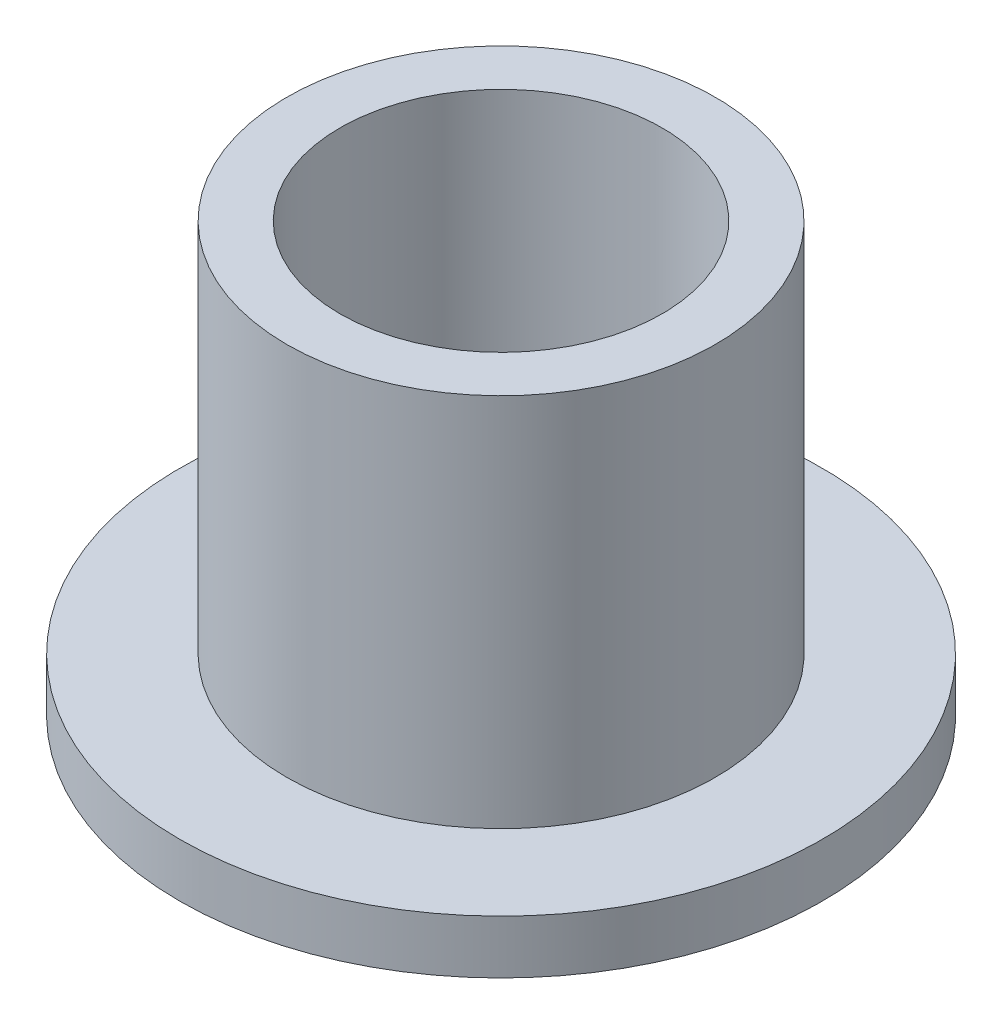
ISO-10303-21;
HEADER;
FILE_DESCRIPTION(('STEP AP214'),'2;1');
FILE_NAME('part.step','',(''),(''),'','','');
FILE_SCHEMA(('AUTOMOTIVE_DESIGN { 1 0 10303 214 1 1 1 1 }'));
ENDSEC;
DATA;
#1=APPLICATION_CONTEXT('core data for automotive mechanical design processes');
#2=APPLICATION_PROTOCOL_DEFINITION('international standard','automotive_design',2000,#1);
#3=PRODUCT_CONTEXT('',#1,'mechanical');
#4=PRODUCT('Part','Part','',(#3));
#5=PRODUCT_RELATED_PRODUCT_CATEGORY('part','',(#4));
#6=PRODUCT_DEFINITION_FORMATION('','',#4);
#7=PRODUCT_DEFINITION_CONTEXT('part definition',#1,'design');
#8=PRODUCT_DEFINITION('design','',#6,#7);
#9=PRODUCT_DEFINITION_SHAPE('','',#8);
#10=(LENGTH_UNIT() NAMED_UNIT(*) SI_UNIT(.MILLI.,.METRE.));
#11=(NAMED_UNIT(*) PLANE_ANGLE_UNIT() SI_UNIT($,.RADIAN.));
#12=(NAMED_UNIT(*) SI_UNIT($,.STERADIAN.) SOLID_ANGLE_UNIT());
#13=UNCERTAINTY_MEASURE_WITH_UNIT(LENGTH_MEASURE(1.E-05),#10,'distance_accuracy_value','');
#14=(GEOMETRIC_REPRESENTATION_CONTEXT(3) GLOBAL_UNCERTAINTY_ASSIGNED_CONTEXT((#13)) GLOBAL_UNIT_ASSIGNED_CONTEXT((#10,
#11,#12)) REPRESENTATION_CONTEXT('',''));
#15=CARTESIAN_POINT('',(0.,0.,0.));
#16=DIRECTION('',(0.,0.,1.));
#17=DIRECTION('',(1.,0.,0.));
#18=AXIS2_PLACEMENT_3D('',#15,#16,#17);
#19=CARTESIAN_POINT('',(0.,6.35,0.));
#20=DIRECTION('',(0.,1.,0.));
#21=DIRECTION('',(0.,0.,1.));
#22=AXIS2_PLACEMENT_3D('',#19,#20,#21);
#23=PLANE('',#22);
#24=CARTESIAN_POINT('',(0.,6.35,0.));
#25=DIRECTION('',(0.,1.,0.));
#26=DIRECTION('',(0.,0.,1.));
#27=AXIS2_PLACEMENT_3D('',#24,#25,#26);
#28=CIRCLE('',#27,3.175);
#29=CARTESIAN_POINT('',(0.,6.35,3.175));
#30=VERTEX_POINT('',#29);
#31=EDGE_CURVE('E10',#30,#30,#28,.T.);
#32=ORIENTED_EDGE('',*,*,#31,.T.);
#33=EDGE_LOOP('',(#32));
#34=FACE_BOUND('',#33,.T.);
#35=CARTESIAN_POINT('',(0.,6.35,0.));
#36=DIRECTION('',(0.,1.,0.));
#37=DIRECTION('',(0.,0.,1.));
#38=AXIS2_PLACEMENT_3D('',#35,#36,#37);
#39=CIRCLE('',#38,2.3876);
#40=CARTESIAN_POINT('',(0.,6.35,2.3876));
#41=VERTEX_POINT('',#40);
#42=EDGE_CURVE('E39',#41,#41,#39,.T.);
#43=ORIENTED_EDGE('',*,*,#42,.F.);
#44=EDGE_LOOP('',(#43));
#45=FACE_BOUND('',#44,.T.);
#46=ADVANCED_FACE('F32',(#34,#45),#23,.T.);
#47=CARTESIAN_POINT('',(0.,0.,0.));
#48=DIRECTION('',(0.,1.,0.));
#49=DIRECTION('',(0.,0.,1.));
#50=AXIS2_PLACEMENT_3D('',#47,#48,#49);
#51=PLANE('',#50);
#52=CARTESIAN_POINT('',(0.,0.,0.));
#53=DIRECTION('',(0.,1.,0.));
#54=DIRECTION('',(0.,0.,1.));
#55=AXIS2_PLACEMENT_3D('',#52,#53,#54);
#56=CIRCLE('',#55,2.3876);
#57=CARTESIAN_POINT('',(0.,0.,2.3876));
#58=VERTEX_POINT('',#57);
#59=EDGE_CURVE('E43',#58,#58,#56,.T.);
#60=ORIENTED_EDGE('',*,*,#59,.T.);
#61=EDGE_LOOP('',(#60));
#62=FACE_BOUND('',#61,.T.);
#63=CARTESIAN_POINT('',(0.,0.,0.));
#64=DIRECTION('',(0.,1.,0.));
#65=DIRECTION('',(0.,0.,1.));
#66=AXIS2_PLACEMENT_3D('',#63,#64,#65);
#67=CIRCLE('',#66,4.7625);
#68=CARTESIAN_POINT('',(0.,0.,4.7625));
#69=VERTEX_POINT('',#68);
#70=EDGE_CURVE('E50',#69,#69,#67,.T.);
#71=ORIENTED_EDGE('',*,*,#70,.F.);
#72=EDGE_LOOP('',(#71));
#73=FACE_BOUND('',#72,.T.);
#74=ADVANCED_FACE('F75',(#62,#73),#51,.F.);
#75=CARTESIAN_POINT('',(0.,6.35,0.));
#76=DIRECTION('',(0.,-1.,0.));
#77=DIRECTION('',(0.,0.,-1.));
#78=AXIS2_PLACEMENT_3D('',#75,#76,#77);
#79=CYLINDRICAL_SURFACE('',#78,3.175);
#80=CARTESIAN_POINT('',(0.,0.79375,0.));
#81=DIRECTION('',(0.,1.,0.));
#82=DIRECTION('',(0.,0.,1.));
#83=AXIS2_PLACEMENT_3D('',#80,#81,#82);
#84=CIRCLE('',#83,3.175);
#85=CARTESIAN_POINT('',(0.,0.79375,3.175));
#86=VERTEX_POINT('',#85);
#87=EDGE_CURVE('E53',#86,#86,#84,.T.);
#88=ORIENTED_EDGE('',*,*,#87,.T.);
#89=EDGE_LOOP('',(#88));
#90=FACE_BOUND('',#89,.T.);
#91=ORIENTED_EDGE('',*,*,#31,.F.);
#92=EDGE_LOOP('',(#91));
#93=FACE_BOUND('',#92,.T.);
#94=ADVANCED_FACE('F34',(#90,#93),#79,.T.);
#95=CARTESIAN_POINT('',(0.,6.35,0.));
#96=DIRECTION('',(0.,-1.,0.));
#97=DIRECTION('',(0.,0.,-1.));
#98=AXIS2_PLACEMENT_3D('',#95,#96,#97);
#99=CYLINDRICAL_SURFACE('',#98,2.3876);
#100=ORIENTED_EDGE('',*,*,#42,.T.);
#101=EDGE_LOOP('',(#100));
#102=FACE_BOUND('',#101,.T.);
#103=ORIENTED_EDGE('',*,*,#59,.F.);
#104=EDGE_LOOP('',(#103));
#105=FACE_BOUND('',#104,.T.);
#106=ADVANCED_FACE('F64',(#102,#105),#99,.F.);
#107=CARTESIAN_POINT('',(0.,0.79375,0.));
#108=DIRECTION('',(0.,1.,0.));
#109=DIRECTION('',(0.,0.,1.));
#110=AXIS2_PLACEMENT_3D('',#107,#108,#109);
#111=PLANE('',#110);
#112=CARTESIAN_POINT('',(0.,0.79375,0.));
#113=DIRECTION('',(0.,1.,0.));
#114=DIRECTION('',(0.,0.,1.));
#115=AXIS2_PLACEMENT_3D('',#112,#113,#114);
#116=CIRCLE('',#115,4.7625);
#117=CARTESIAN_POINT('',(0.,0.79375,4.7625));
#118=VERTEX_POINT('',#117);
#119=EDGE_CURVE('E48',#118,#118,#116,.T.);
#120=ORIENTED_EDGE('',*,*,#119,.T.);
#121=EDGE_LOOP('',(#120));
#122=FACE_BOUND('',#121,.T.);
#123=ORIENTED_EDGE('',*,*,#87,.F.);
#124=EDGE_LOOP('',(#123));
#125=FACE_BOUND('',#124,.T.);
#126=ADVANCED_FACE('F61',(#122,#125),#111,.T.);
#127=CARTESIAN_POINT('',(0.,0.79375,0.));
#128=DIRECTION('',(0.,-1.,0.));
#129=DIRECTION('',(0.,0.,-1.));
#130=AXIS2_PLACEMENT_3D('',#127,#128,#129);
#131=CYLINDRICAL_SURFACE('',#130,4.7625);
#132=ORIENTED_EDGE('',*,*,#119,.F.);
#133=EDGE_LOOP('',(#132));
#134=FACE_BOUND('',#133,.T.);
#135=ORIENTED_EDGE('',*,*,#70,.T.);
#136=EDGE_LOOP('',(#135));
#137=FACE_BOUND('',#136,.T.);
#138=ADVANCED_FACE('F63',(#134,#137),#131,.T.);
#139=CLOSED_SHELL('',(#46,#74,#94,#106,#126,#138));
#140=MANIFOLD_SOLID_BREP('B2',#139);
#141=ADVANCED_BREP_SHAPE_REPRESENTATION('',(#18,#140),#14);
#142=SHAPE_DEFINITION_REPRESENTATION(#9,#141);
ENDSEC;
END-ISO-10303-21;
